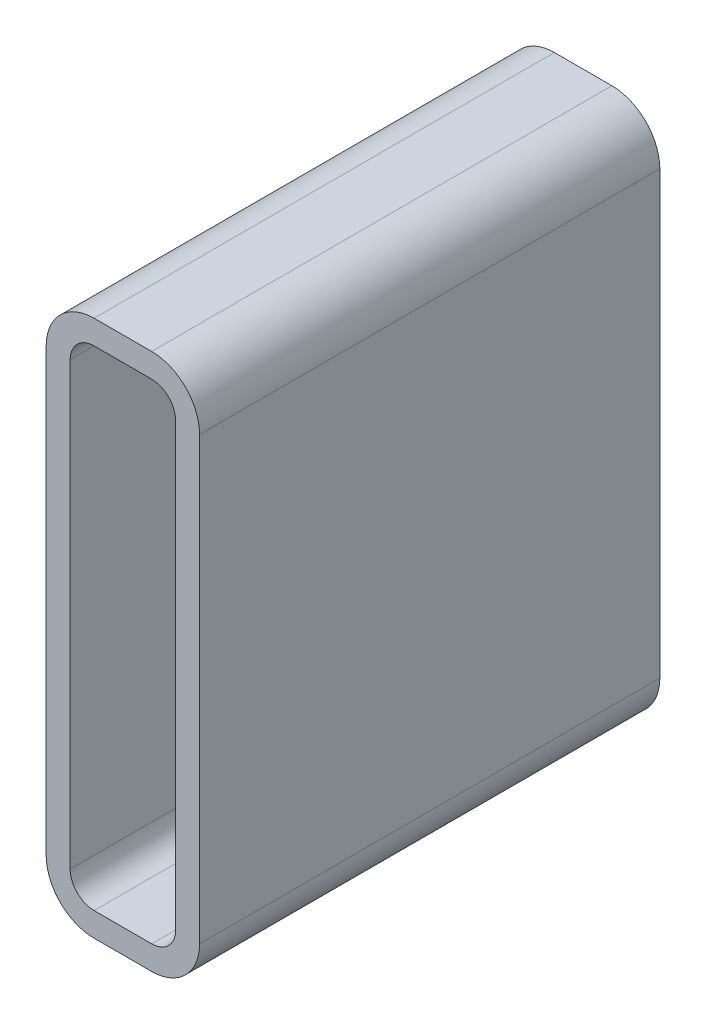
ISO-10303-21;
HEADER;
FILE_DESCRIPTION(('STEP AP214'),'2;1');
FILE_NAME('part.step','',(''),(''),'','','');
FILE_SCHEMA(('AUTOMOTIVE_DESIGN { 1 0 10303 214 1 1 1 1 }'));
ENDSEC;
DATA;
#1=APPLICATION_CONTEXT('core data for automotive mechanical design processes');
#2=APPLICATION_PROTOCOL_DEFINITION('international standard','automotive_design',2000,#1);
#3=PRODUCT_CONTEXT('',#1,'mechanical');
#4=PRODUCT('Part','Part','',(#3));
#5=PRODUCT_RELATED_PRODUCT_CATEGORY('part','',(#4));
#6=PRODUCT_DEFINITION_FORMATION('','',#4);
#7=PRODUCT_DEFINITION_CONTEXT('part definition',#1,'design');
#8=PRODUCT_DEFINITION('design','',#6,#7);
#9=PRODUCT_DEFINITION_SHAPE('','',#8);
#10=(LENGTH_UNIT() NAMED_UNIT(*) SI_UNIT(.MILLI.,.METRE.));
#11=(NAMED_UNIT(*) PLANE_ANGLE_UNIT() SI_UNIT($,.RADIAN.));
#12=(NAMED_UNIT(*) SI_UNIT($,.STERADIAN.) SOLID_ANGLE_UNIT());
#13=UNCERTAINTY_MEASURE_WITH_UNIT(LENGTH_MEASURE(1.E-05),#10,'distance_accuracy_value','');
#14=(GEOMETRIC_REPRESENTATION_CONTEXT(3) GLOBAL_UNCERTAINTY_ASSIGNED_CONTEXT((#13)) GLOBAL_UNIT_ASSIGNED_CONTEXT((#10,
#11,#12)) REPRESENTATION_CONTEXT('',''));
#15=CARTESIAN_POINT('',(0.,0.,0.));
#16=DIRECTION('',(0.,0.,1.));
#17=DIRECTION('',(1.,0.,0.));
#18=AXIS2_PLACEMENT_3D('',#15,#16,#17);
#19=CARTESIAN_POINT('',(33.4251778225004,325.678679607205,304.8));
#20=DIRECTION('',(0.,0.,1.));
#21=DIRECTION('',(1.,0.,0.));
#22=AXIS2_PLACEMENT_3D('',#19,#20,#21);
#23=PLANE('',#22);
#24=CARTESIAN_POINT('',(33.4251778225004,325.678679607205,304.8));
#25=DIRECTION('',(0.,0.,1.));
#26=DIRECTION('',(1.,0.,0.));
#27=AXIS2_PLACEMENT_3D('',#24,#25,#26);
#28=CIRCLE('',#27,31.75);
#29=CARTESIAN_POINT('',(33.4251778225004,357.428679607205,304.8));
#30=VERTEX_POINT('',#29);
#31=CARTESIAN_POINT('',(1.67517782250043,325.678679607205,304.8));
#32=VERTEX_POINT('',#31);
#33=EDGE_CURVE('E211',#30,#32,#28,.T.);
#34=ORIENTED_EDGE('',*,*,#33,.T.);
#35=DIRECTION('',(0.,-1.,0.));
#36=VECTOR('',#35,1.);
#37=CARTESIAN_POINT('',(1.67517782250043,33.5786796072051,304.8));
#38=LINE('',#37,#36);
#39=CARTESIAN_POINT('',(1.67517782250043,33.5786796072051,304.8));
#40=VERTEX_POINT('',#39);
#41=EDGE_CURVE('E214',#32,#40,#38,.T.);
#42=ORIENTED_EDGE('',*,*,#41,.T.);
#43=CARTESIAN_POINT('',(33.4251778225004,33.5786796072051,304.8));
#44=DIRECTION('',(0.,0.,1.));
#45=DIRECTION('',(1.,0.,0.));
#46=AXIS2_PLACEMENT_3D('',#43,#44,#45);
#47=CIRCLE('',#46,31.75);
#48=CARTESIAN_POINT('',(33.4251778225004,1.82867960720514,304.8));
#49=VERTEX_POINT('',#48);
#50=EDGE_CURVE('E217',#40,#49,#47,.T.);
#51=ORIENTED_EDGE('',*,*,#50,.T.);
#52=DIRECTION('',(1.,0.,0.));
#53=VECTOR('',#52,1.);
#54=CARTESIAN_POINT('',(71.5251778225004,1.82867960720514,304.8));
#55=LINE('',#54,#53);
#56=CARTESIAN_POINT('',(71.5251778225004,1.82867960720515,304.8));
#57=VERTEX_POINT('',#56);
#58=EDGE_CURVE('E219',#49,#57,#55,.T.);
#59=ORIENTED_EDGE('',*,*,#58,.T.);
#60=CARTESIAN_POINT('',(71.5251778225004,33.5786796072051,304.8));
#61=DIRECTION('',(0.,0.,1.));
#62=DIRECTION('',(1.,0.,0.));
#63=AXIS2_PLACEMENT_3D('',#60,#61,#62);
#64=CIRCLE('',#63,31.75);
#65=CARTESIAN_POINT('',(103.2751778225,33.5786796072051,304.8));
#66=VERTEX_POINT('',#65);
#67=EDGE_CURVE('E221',#57,#66,#64,.T.);
#68=ORIENTED_EDGE('',*,*,#67,.T.);
#69=DIRECTION('',(0.,1.,0.));
#70=VECTOR('',#69,1.);
#71=CARTESIAN_POINT('',(103.2751778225,325.678679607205,304.8));
#72=LINE('',#71,#70);
#73=CARTESIAN_POINT('',(103.2751778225,325.678679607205,304.8));
#74=VERTEX_POINT('',#73);
#75=EDGE_CURVE('E223',#66,#74,#72,.T.);
#76=ORIENTED_EDGE('',*,*,#75,.T.);
#77=CARTESIAN_POINT('',(71.5251778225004,325.678679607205,304.8));
#78=DIRECTION('',(0.,0.,1.));
#79=DIRECTION('',(1.,0.,0.));
#80=AXIS2_PLACEMENT_3D('',#77,#78,#79);
#81=CIRCLE('',#80,31.75);
#82=CARTESIAN_POINT('',(71.5251778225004,357.428679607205,304.8));
#83=VERTEX_POINT('',#82);
#84=EDGE_CURVE('E225',#74,#83,#81,.T.);
#85=ORIENTED_EDGE('',*,*,#84,.T.);
#86=DIRECTION('',(-1.,0.,0.));
#87=VECTOR('',#86,1.);
#88=CARTESIAN_POINT('',(33.4251778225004,357.428679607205,304.8));
#89=LINE('',#88,#87);
#90=EDGE_CURVE('E227',#83,#30,#89,.T.);
#91=ORIENTED_EDGE('',*,*,#90,.T.);
#92=EDGE_LOOP('',(#34,#42,#51,#59,#68,#76,#85,#91));
#93=FACE_BOUND('',#92,.T.);
#94=DIRECTION('',(0.,-1.,0.));
#95=VECTOR('',#94,1.);
#96=CARTESIAN_POINT('',(17.5501778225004,33.5786796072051,304.8));
#97=LINE('',#96,#95);
#98=CARTESIAN_POINT('',(17.5501778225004,325.678679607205,304.8));
#99=VERTEX_POINT('',#98);
#100=CARTESIAN_POINT('',(17.5501778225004,33.5786796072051,304.8));
#101=VERTEX_POINT('',#100);
#102=EDGE_CURVE('E154',#99,#101,#97,.T.);
#103=ORIENTED_EDGE('',*,*,#102,.F.);
#104=CARTESIAN_POINT('',(33.4251778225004,325.678679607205,304.8));
#105=DIRECTION('',(0.,0.,1.));
#106=DIRECTION('',(1.,0.,0.));
#107=AXIS2_PLACEMENT_3D('',#104,#105,#106);
#108=CIRCLE('',#107,15.875);
#109=CARTESIAN_POINT('',(33.4251778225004,341.553679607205,304.8));
#110=VERTEX_POINT('',#109);
#111=EDGE_CURVE('E146',#110,#99,#108,.T.);
#112=ORIENTED_EDGE('',*,*,#111,.F.);
#113=DIRECTION('',(-1.,0.,0.));
#114=VECTOR('',#113,1.);
#115=CARTESIAN_POINT('',(33.4251778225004,341.553679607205,304.8));
#116=LINE('',#115,#114);
#117=CARTESIAN_POINT('',(71.5251778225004,341.553679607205,304.8));
#118=VERTEX_POINT('',#117);
#119=EDGE_CURVE('E179',#118,#110,#116,.T.);
#120=ORIENTED_EDGE('',*,*,#119,.F.);
#121=CARTESIAN_POINT('',(71.5251778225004,325.678679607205,304.8));
#122=DIRECTION('',(0.,0.,1.));
#123=DIRECTION('',(1.,0.,0.));
#124=AXIS2_PLACEMENT_3D('',#121,#122,#123);
#125=CIRCLE('',#124,15.875);
#126=CARTESIAN_POINT('',(87.4001778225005,325.678679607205,304.8));
#127=VERTEX_POINT('',#126);
#128=EDGE_CURVE('E177',#127,#118,#125,.T.);
#129=ORIENTED_EDGE('',*,*,#128,.F.);
#130=DIRECTION('',(0.,1.,0.));
#131=VECTOR('',#130,1.);
#132=CARTESIAN_POINT('',(87.4001778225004,325.678679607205,304.8));
#133=LINE('',#132,#131);
#134=CARTESIAN_POINT('',(87.4001778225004,33.5786796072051,304.8));
#135=VERTEX_POINT('',#134);
#136=EDGE_CURVE('E175',#135,#127,#133,.T.);
#137=ORIENTED_EDGE('',*,*,#136,.F.);
#138=CARTESIAN_POINT('',(71.5251778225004,33.5786796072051,304.8));
#139=DIRECTION('',(0.,0.,1.));
#140=DIRECTION('',(1.,0.,0.));
#141=AXIS2_PLACEMENT_3D('',#138,#139,#140);
#142=CIRCLE('',#141,15.875);
#143=CARTESIAN_POINT('',(71.5251778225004,17.7036796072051,304.8));
#144=VERTEX_POINT('',#143);
#145=EDGE_CURVE('E173',#144,#135,#142,.T.);
#146=ORIENTED_EDGE('',*,*,#145,.F.);
#147=DIRECTION('',(1.,0.,0.));
#148=VECTOR('',#147,1.);
#149=CARTESIAN_POINT('',(71.5251778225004,17.7036796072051,304.8));
#150=LINE('',#149,#148);
#151=CARTESIAN_POINT('',(33.4251778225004,17.7036796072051,304.8));
#152=VERTEX_POINT('',#151);
#153=EDGE_CURVE('E169',#152,#144,#150,.T.);
#154=ORIENTED_EDGE('',*,*,#153,.F.);
#155=CARTESIAN_POINT('',(33.4251778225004,33.5786796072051,304.8));
#156=DIRECTION('',(0.,0.,1.));
#157=DIRECTION('',(1.,0.,0.));
#158=AXIS2_PLACEMENT_3D('',#155,#156,#157);
#159=CIRCLE('',#158,15.875);
#160=EDGE_CURVE('E167',#101,#152,#159,.T.);
#161=ORIENTED_EDGE('',*,*,#160,.F.);
#162=EDGE_LOOP('',(#103,#112,#120,#129,#137,#146,#154,#161));
#163=FACE_BOUND('',#162,.T.);
#164=ADVANCED_FACE('F33',(#93,#163),#23,.T.);
#165=CARTESIAN_POINT('',(33.4251778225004,325.678679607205,0.));
#166=DIRECTION('',(0.,0.,1.));
#167=DIRECTION('',(1.,0.,0.));
#168=AXIS2_PLACEMENT_3D('',#165,#166,#167);
#169=PLANE('',#168);
#170=CARTESIAN_POINT('',(33.4251778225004,325.678679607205,0.));
#171=DIRECTION('',(0.,0.,1.));
#172=DIRECTION('',(1.,0.,0.));
#173=AXIS2_PLACEMENT_3D('',#170,#171,#172);
#174=CIRCLE('',#173,31.75);
#175=CARTESIAN_POINT('',(33.4251778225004,357.428679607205,0.));
#176=VERTEX_POINT('',#175);
#177=CARTESIAN_POINT('',(1.67517782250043,325.678679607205,0.));
#178=VERTEX_POINT('',#177);
#179=EDGE_CURVE('E162',#176,#178,#174,.T.);
#180=ORIENTED_EDGE('',*,*,#179,.F.);
#181=DIRECTION('',(-1.,0.,0.));
#182=VECTOR('',#181,1.);
#183=CARTESIAN_POINT('',(33.4251778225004,357.428679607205,0.));
#184=LINE('',#183,#182);
#185=CARTESIAN_POINT('',(71.5251778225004,357.428679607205,0.));
#186=VERTEX_POINT('',#185);
#187=EDGE_CURVE('E215',#186,#176,#184,.T.);
#188=ORIENTED_EDGE('',*,*,#187,.F.);
#189=CARTESIAN_POINT('',(71.5251778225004,325.678679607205,0.));
#190=DIRECTION('',(0.,0.,1.));
#191=DIRECTION('',(1.,0.,0.));
#192=AXIS2_PLACEMENT_3D('',#189,#190,#191);
#193=CIRCLE('',#192,31.75);
#194=CARTESIAN_POINT('',(103.2751778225,325.678679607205,0.));
#195=VERTEX_POINT('',#194);
#196=EDGE_CURVE('E242',#195,#186,#193,.T.);
#197=ORIENTED_EDGE('',*,*,#196,.F.);
#198=DIRECTION('',(0.,1.,0.));
#199=VECTOR('',#198,1.);
#200=CARTESIAN_POINT('',(103.2751778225,325.678679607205,0.));
#201=LINE('',#200,#199);
#202=CARTESIAN_POINT('',(103.2751778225,33.5786796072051,0.));
#203=VERTEX_POINT('',#202);
#204=EDGE_CURVE('E240',#203,#195,#201,.T.);
#205=ORIENTED_EDGE('',*,*,#204,.F.);
#206=CARTESIAN_POINT('',(71.5251778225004,33.5786796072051,0.));
#207=DIRECTION('',(0.,0.,1.));
#208=DIRECTION('',(1.,0.,0.));
#209=AXIS2_PLACEMENT_3D('',#206,#207,#208);
#210=CIRCLE('',#209,31.75);
#211=CARTESIAN_POINT('',(71.5251778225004,1.82867960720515,0.));
#212=VERTEX_POINT('',#211);
#213=EDGE_CURVE('E238',#212,#203,#210,.T.);
#214=ORIENTED_EDGE('',*,*,#213,.F.);
#215=DIRECTION('',(1.,0.,0.));
#216=VECTOR('',#215,1.);
#217=CARTESIAN_POINT('',(71.5251778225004,1.82867960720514,0.));
#218=LINE('',#217,#216);
#219=CARTESIAN_POINT('',(33.4251778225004,1.82867960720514,0.));
#220=VERTEX_POINT('',#219);
#221=EDGE_CURVE('E236',#220,#212,#218,.T.);
#222=ORIENTED_EDGE('',*,*,#221,.F.);
#223=CARTESIAN_POINT('',(33.4251778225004,33.5786796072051,0.));
#224=DIRECTION('',(0.,0.,1.));
#225=DIRECTION('',(1.,0.,0.));
#226=AXIS2_PLACEMENT_3D('',#223,#224,#225);
#227=CIRCLE('',#226,31.75);
#228=CARTESIAN_POINT('',(1.67517782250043,33.5786796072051,0.));
#229=VERTEX_POINT('',#228);
#230=EDGE_CURVE('E234',#229,#220,#227,.T.);
#231=ORIENTED_EDGE('',*,*,#230,.F.);
#232=DIRECTION('',(0.,-1.,0.));
#233=VECTOR('',#232,1.);
#234=CARTESIAN_POINT('',(1.67517782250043,33.5786796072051,0.));
#235=LINE('',#234,#233);
#236=EDGE_CURVE('E232',#178,#229,#235,.T.);
#237=ORIENTED_EDGE('',*,*,#236,.F.);
#238=EDGE_LOOP('',(#180,#188,#197,#205,#214,#222,#231,#237));
#239=FACE_BOUND('',#238,.T.);
#240=CARTESIAN_POINT('',(33.4251778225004,325.678679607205,0.));
#241=DIRECTION('',(0.,0.,1.));
#242=DIRECTION('',(1.,0.,0.));
#243=AXIS2_PLACEMENT_3D('',#240,#241,#242);
#244=CIRCLE('',#243,15.875);
#245=CARTESIAN_POINT('',(33.4251778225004,341.553679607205,0.));
#246=VERTEX_POINT('',#245);
#247=CARTESIAN_POINT('',(17.5501778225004,325.678679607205,0.));
#248=VERTEX_POINT('',#247);
#249=EDGE_CURVE('E56',#246,#248,#244,.T.);
#250=ORIENTED_EDGE('',*,*,#249,.T.);
#251=DIRECTION('',(0.,-1.,0.));
#252=VECTOR('',#251,1.);
#253=CARTESIAN_POINT('',(17.5501778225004,33.5786796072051,0.));
#254=LINE('',#253,#252);
#255=CARTESIAN_POINT('',(17.5501778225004,33.5786796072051,0.));
#256=VERTEX_POINT('',#255);
#257=EDGE_CURVE('E161',#248,#256,#254,.T.);
#258=ORIENTED_EDGE('',*,*,#257,.T.);
#259=CARTESIAN_POINT('',(33.4251778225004,33.5786796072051,0.));
#260=DIRECTION('',(0.,0.,1.));
#261=DIRECTION('',(1.,0.,0.));
#262=AXIS2_PLACEMENT_3D('',#259,#260,#261);
#263=CIRCLE('',#262,15.875);
#264=CARTESIAN_POINT('',(33.4251778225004,17.7036796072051,0.));
#265=VERTEX_POINT('',#264);
#266=EDGE_CURVE('E183',#256,#265,#263,.T.);
#267=ORIENTED_EDGE('',*,*,#266,.T.);
#268=DIRECTION('',(1.,0.,0.));
#269=VECTOR('',#268,1.);
#270=CARTESIAN_POINT('',(71.5251778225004,17.7036796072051,0.));
#271=LINE('',#270,#269);
#272=CARTESIAN_POINT('',(71.5251778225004,17.7036796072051,0.));
#273=VERTEX_POINT('',#272);
#274=EDGE_CURVE('E186',#265,#273,#271,.T.);
#275=ORIENTED_EDGE('',*,*,#274,.T.);
#276=CARTESIAN_POINT('',(71.5251778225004,33.5786796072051,0.));
#277=DIRECTION('',(0.,0.,1.));
#278=DIRECTION('',(1.,0.,0.));
#279=AXIS2_PLACEMENT_3D('',#276,#277,#278);
#280=CIRCLE('',#279,15.875);
#281=CARTESIAN_POINT('',(87.4001778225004,33.5786796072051,0.));
#282=VERTEX_POINT('',#281);
#283=EDGE_CURVE('E189',#273,#282,#280,.T.);
#284=ORIENTED_EDGE('',*,*,#283,.T.);
#285=DIRECTION('',(0.,1.,0.));
#286=VECTOR('',#285,1.);
#287=CARTESIAN_POINT('',(87.4001778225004,325.678679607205,0.));
#288=LINE('',#287,#286);
#289=CARTESIAN_POINT('',(87.4001778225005,325.678679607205,0.));
#290=VERTEX_POINT('',#289);
#291=EDGE_CURVE('E192',#282,#290,#288,.T.);
#292=ORIENTED_EDGE('',*,*,#291,.T.);
#293=CARTESIAN_POINT('',(71.5251778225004,325.678679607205,0.));
#294=DIRECTION('',(0.,0.,1.));
#295=DIRECTION('',(1.,0.,0.));
#296=AXIS2_PLACEMENT_3D('',#293,#294,#295);
#297=CIRCLE('',#296,15.875);
#298=CARTESIAN_POINT('',(71.5251778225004,341.553679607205,0.));
#299=VERTEX_POINT('',#298);
#300=EDGE_CURVE('E195',#290,#299,#297,.T.);
#301=ORIENTED_EDGE('',*,*,#300,.T.);
#302=DIRECTION('',(-1.,0.,0.));
#303=VECTOR('',#302,1.);
#304=CARTESIAN_POINT('',(33.4251778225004,341.553679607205,0.));
#305=LINE('',#304,#303);
#306=EDGE_CURVE('E155',#299,#246,#305,.T.);
#307=ORIENTED_EDGE('',*,*,#306,.T.);
#308=EDGE_LOOP('',(#250,#258,#267,#275,#284,#292,#301,#307));
#309=FACE_BOUND('',#308,.T.);
#310=ADVANCED_FACE('F272',(#239,#309),#169,.F.);
#311=CARTESIAN_POINT('',(33.4251778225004,325.678679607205,304.8));
#312=DIRECTION('',(0.,0.,-1.));
#313=DIRECTION('',(-1.,0.,0.));
#314=AXIS2_PLACEMENT_3D('',#311,#312,#313);
#315=CYLINDRICAL_SURFACE('',#314,31.75);
#316=ORIENTED_EDGE('',*,*,#179,.T.);
#317=DIRECTION('',(0.,0.,-1.));
#318=VECTOR('',#317,1.);
#319=CARTESIAN_POINT('',(1.67517782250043,325.678679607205,304.8));
#320=LINE('',#319,#318);
#321=EDGE_CURVE('E11',#32,#178,#320,.T.);
#322=ORIENTED_EDGE('',*,*,#321,.F.);
#323=ORIENTED_EDGE('',*,*,#33,.F.);
#324=DIRECTION('',(0.,0.,-1.));
#325=VECTOR('',#324,1.);
#326=CARTESIAN_POINT('',(33.4251778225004,357.428679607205,304.8));
#327=LINE('',#326,#325);
#328=EDGE_CURVE('E229',#30,#176,#327,.T.);
#329=ORIENTED_EDGE('',*,*,#328,.T.);
#330=EDGE_LOOP('',(#316,#322,#323,#329));
#331=FACE_BOUND('',#330,.T.);
#332=ADVANCED_FACE('F35',(#331),#315,.T.);
#333=CARTESIAN_POINT('',(1.67517782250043,33.5786796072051,304.8));
#334=DIRECTION('',(1.,0.,0.));
#335=DIRECTION('',(0.,0.,-1.));
#336=AXIS2_PLACEMENT_3D('',#333,#334,#335);
#337=PLANE('',#336);
#338=ORIENTED_EDGE('',*,*,#236,.T.);
#339=DIRECTION('',(0.,0.,-1.));
#340=VECTOR('',#339,1.);
#341=CARTESIAN_POINT('',(1.67517782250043,33.5786796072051,304.8));
#342=LINE('',#341,#340);
#343=EDGE_CURVE('E41',#40,#229,#342,.T.);
#344=ORIENTED_EDGE('',*,*,#343,.F.);
#345=ORIENTED_EDGE('',*,*,#41,.F.);
#346=ORIENTED_EDGE('',*,*,#321,.T.);
#347=EDGE_LOOP('',(#338,#344,#345,#346));
#348=FACE_BOUND('',#347,.T.);
#349=ADVANCED_FACE('F289',(#348),#337,.F.);
#350=CARTESIAN_POINT('',(33.4251778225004,33.5786796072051,304.8));
#351=DIRECTION('',(0.,0.,-1.));
#352=DIRECTION('',(-1.,0.,0.));
#353=AXIS2_PLACEMENT_3D('',#350,#351,#352);
#354=CYLINDRICAL_SURFACE('',#353,31.75);
#355=ORIENTED_EDGE('',*,*,#230,.T.);
#356=DIRECTION('',(0.,0.,-1.));
#357=VECTOR('',#356,1.);
#358=CARTESIAN_POINT('',(33.4251778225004,1.82867960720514,304.8));
#359=LINE('',#358,#357);
#360=EDGE_CURVE('E259',#49,#220,#359,.T.);
#361=ORIENTED_EDGE('',*,*,#360,.F.);
#362=ORIENTED_EDGE('',*,*,#50,.F.);
#363=ORIENTED_EDGE('',*,*,#343,.T.);
#364=EDGE_LOOP('',(#355,#361,#362,#363));
#365=FACE_BOUND('',#364,.T.);
#366=ADVANCED_FACE('F266',(#365),#354,.T.);
#367=CARTESIAN_POINT('',(71.5251778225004,1.82867960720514,304.8));
#368=DIRECTION('',(0.,1.,0.));
#369=DIRECTION('',(0.,0.,1.));
#370=AXIS2_PLACEMENT_3D('',#367,#368,#369);
#371=PLANE('',#370);
#372=ORIENTED_EDGE('',*,*,#221,.T.);
#373=DIRECTION('',(0.,0.,-1.));
#374=VECTOR('',#373,1.);
#375=CARTESIAN_POINT('',(71.5251778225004,1.82867960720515,304.8));
#376=LINE('',#375,#374);
#377=EDGE_CURVE('E256',#57,#212,#376,.T.);
#378=ORIENTED_EDGE('',*,*,#377,.F.);
#379=ORIENTED_EDGE('',*,*,#58,.F.);
#380=ORIENTED_EDGE('',*,*,#360,.T.);
#381=EDGE_LOOP('',(#372,#378,#379,#380));
#382=FACE_BOUND('',#381,.T.);
#383=ADVANCED_FACE('F278',(#382),#371,.F.);
#384=CARTESIAN_POINT('',(71.5251778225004,33.5786796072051,304.8));
#385=DIRECTION('',(0.,0.,-1.));
#386=DIRECTION('',(-1.,0.,0.));
#387=AXIS2_PLACEMENT_3D('',#384,#385,#386);
#388=CYLINDRICAL_SURFACE('',#387,31.75);
#389=ORIENTED_EDGE('',*,*,#213,.T.);
#390=DIRECTION('',(0.,0.,-1.));
#391=VECTOR('',#390,1.);
#392=CARTESIAN_POINT('',(103.2751778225,33.5786796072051,304.8));
#393=LINE('',#392,#391);
#394=EDGE_CURVE('E253',#66,#203,#393,.T.);
#395=ORIENTED_EDGE('',*,*,#394,.F.);
#396=ORIENTED_EDGE('',*,*,#67,.F.);
#397=ORIENTED_EDGE('',*,*,#377,.T.);
#398=EDGE_LOOP('',(#389,#395,#396,#397));
#399=FACE_BOUND('',#398,.T.);
#400=ADVANCED_FACE('F282',(#399),#388,.T.);
#401=CARTESIAN_POINT('',(103.2751778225,325.678679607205,304.8));
#402=DIRECTION('',(-1.,0.,0.));
#403=DIRECTION('',(0.,0.,1.));
#404=AXIS2_PLACEMENT_3D('',#401,#402,#403);
#405=PLANE('',#404);
#406=ORIENTED_EDGE('',*,*,#204,.T.);
#407=DIRECTION('',(0.,0.,-1.));
#408=VECTOR('',#407,1.);
#409=CARTESIAN_POINT('',(103.2751778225,325.678679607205,304.8));
#410=LINE('',#409,#408);
#411=EDGE_CURVE('E250',#74,#195,#410,.T.);
#412=ORIENTED_EDGE('',*,*,#411,.F.);
#413=ORIENTED_EDGE('',*,*,#75,.F.);
#414=ORIENTED_EDGE('',*,*,#394,.T.);
#415=EDGE_LOOP('',(#406,#412,#413,#414));
#416=FACE_BOUND('',#415,.T.);
#417=ADVANCED_FACE('F302',(#416),#405,.F.);
#418=CARTESIAN_POINT('',(71.5251778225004,325.678679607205,304.8));
#419=DIRECTION('',(0.,0.,-1.));
#420=DIRECTION('',(-1.,0.,0.));
#421=AXIS2_PLACEMENT_3D('',#418,#419,#420);
#422=CYLINDRICAL_SURFACE('',#421,31.75);
#423=ORIENTED_EDGE('',*,*,#196,.T.);
#424=DIRECTION('',(0.,0.,-1.));
#425=VECTOR('',#424,1.);
#426=CARTESIAN_POINT('',(71.5251778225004,357.428679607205,304.8));
#427=LINE('',#426,#425);
#428=EDGE_CURVE('E247',#83,#186,#427,.T.);
#429=ORIENTED_EDGE('',*,*,#428,.F.);
#430=ORIENTED_EDGE('',*,*,#84,.F.);
#431=ORIENTED_EDGE('',*,*,#411,.T.);
#432=EDGE_LOOP('',(#423,#429,#430,#431));
#433=FACE_BOUND('',#432,.T.);
#434=ADVANCED_FACE('F300',(#433),#422,.T.);
#435=CARTESIAN_POINT('',(33.4251778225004,357.428679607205,304.8));
#436=DIRECTION('',(0.,-1.,0.));
#437=DIRECTION('',(0.,0.,-1.));
#438=AXIS2_PLACEMENT_3D('',#435,#436,#437);
#439=PLANE('',#438);
#440=ORIENTED_EDGE('',*,*,#187,.T.);
#441=ORIENTED_EDGE('',*,*,#328,.F.);
#442=ORIENTED_EDGE('',*,*,#90,.F.);
#443=ORIENTED_EDGE('',*,*,#428,.T.);
#444=EDGE_LOOP('',(#440,#441,#442,#443));
#445=FACE_BOUND('',#444,.T.);
#446=ADVANCED_FACE('F295',(#445),#439,.F.);
#447=CARTESIAN_POINT('',(33.4251778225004,325.678679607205,304.8));
#448=DIRECTION('',(0.,0.,-1.));
#449=DIRECTION('',(-1.,0.,0.));
#450=AXIS2_PLACEMENT_3D('',#447,#448,#449);
#451=CYLINDRICAL_SURFACE('',#450,15.875);
#452=ORIENTED_EDGE('',*,*,#249,.F.);
#453=DIRECTION('',(0.,0.,-1.));
#454=VECTOR('',#453,1.);
#455=CARTESIAN_POINT('',(33.4251778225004,341.553679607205,304.8));
#456=LINE('',#455,#454);
#457=EDGE_CURVE('E150',#110,#246,#456,.T.);
#458=ORIENTED_EDGE('',*,*,#457,.F.);
#459=ORIENTED_EDGE('',*,*,#111,.T.);
#460=DIRECTION('',(0.,0.,-1.));
#461=VECTOR('',#460,1.);
#462=CARTESIAN_POINT('',(17.5501778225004,325.678679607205,304.8));
#463=LINE('',#462,#461);
#464=EDGE_CURVE('E149',#99,#248,#463,.T.);
#465=ORIENTED_EDGE('',*,*,#464,.T.);
#466=EDGE_LOOP('',(#452,#458,#459,#465));
#467=FACE_BOUND('',#466,.T.);
#468=ADVANCED_FACE('F148',(#467),#451,.F.);
#469=CARTESIAN_POINT('',(17.5501778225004,33.5786796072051,304.8));
#470=DIRECTION('',(1.,0.,0.));
#471=DIRECTION('',(0.,0.,-1.));
#472=AXIS2_PLACEMENT_3D('',#469,#470,#471);
#473=PLANE('',#472);
#474=ORIENTED_EDGE('',*,*,#257,.F.);
#475=ORIENTED_EDGE('',*,*,#464,.F.);
#476=ORIENTED_EDGE('',*,*,#102,.T.);
#477=DIRECTION('',(0.,0.,-1.));
#478=VECTOR('',#477,1.);
#479=CARTESIAN_POINT('',(17.5501778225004,33.5786796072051,304.8));
#480=LINE('',#479,#478);
#481=EDGE_CURVE('E163',#101,#256,#480,.T.);
#482=ORIENTED_EDGE('',*,*,#481,.T.);
#483=EDGE_LOOP('',(#474,#475,#476,#482));
#484=FACE_BOUND('',#483,.T.);
#485=ADVANCED_FACE('F158',(#484),#473,.T.);
#486=CARTESIAN_POINT('',(33.4251778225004,33.5786796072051,304.8));
#487=DIRECTION('',(0.,0.,-1.));
#488=DIRECTION('',(-1.,0.,0.));
#489=AXIS2_PLACEMENT_3D('',#486,#487,#488);
#490=CYLINDRICAL_SURFACE('',#489,15.875);
#491=ORIENTED_EDGE('',*,*,#266,.F.);
#492=ORIENTED_EDGE('',*,*,#481,.F.);
#493=ORIENTED_EDGE('',*,*,#160,.T.);
#494=DIRECTION('',(0.,0.,-1.));
#495=VECTOR('',#494,1.);
#496=CARTESIAN_POINT('',(33.4251778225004,17.7036796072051,304.8));
#497=LINE('',#496,#495);
#498=EDGE_CURVE('E208',#152,#265,#497,.T.);
#499=ORIENTED_EDGE('',*,*,#498,.T.);
#500=EDGE_LOOP('',(#491,#492,#493,#499));
#501=FACE_BOUND('',#500,.T.);
#502=ADVANCED_FACE('F327',(#501),#490,.F.);
#503=CARTESIAN_POINT('',(71.5251778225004,17.7036796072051,304.8));
#504=DIRECTION('',(0.,1.,0.));
#505=DIRECTION('',(0.,0.,1.));
#506=AXIS2_PLACEMENT_3D('',#503,#504,#505);
#507=PLANE('',#506);
#508=ORIENTED_EDGE('',*,*,#274,.F.);
#509=ORIENTED_EDGE('',*,*,#498,.F.);
#510=ORIENTED_EDGE('',*,*,#153,.T.);
#511=DIRECTION('',(0.,0.,-1.));
#512=VECTOR('',#511,1.);
#513=CARTESIAN_POINT('',(71.5251778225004,17.7036796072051,304.8));
#514=LINE('',#513,#512);
#515=EDGE_CURVE('E206',#144,#273,#514,.T.);
#516=ORIENTED_EDGE('',*,*,#515,.T.);
#517=EDGE_LOOP('',(#508,#509,#510,#516));
#518=FACE_BOUND('',#517,.T.);
#519=ADVANCED_FACE('F331',(#518),#507,.T.);
#520=CARTESIAN_POINT('',(71.5251778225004,33.5786796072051,304.8));
#521=DIRECTION('',(0.,0.,-1.));
#522=DIRECTION('',(-1.,0.,0.));
#523=AXIS2_PLACEMENT_3D('',#520,#521,#522);
#524=CYLINDRICAL_SURFACE('',#523,15.875);
#525=ORIENTED_EDGE('',*,*,#283,.F.);
#526=ORIENTED_EDGE('',*,*,#515,.F.);
#527=ORIENTED_EDGE('',*,*,#145,.T.);
#528=DIRECTION('',(0.,0.,-1.));
#529=VECTOR('',#528,1.);
#530=CARTESIAN_POINT('',(87.4001778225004,33.5786796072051,304.8));
#531=LINE('',#530,#529);
#532=EDGE_CURVE('E204',#135,#282,#531,.T.);
#533=ORIENTED_EDGE('',*,*,#532,.T.);
#534=EDGE_LOOP('',(#525,#526,#527,#533));
#535=FACE_BOUND('',#534,.T.);
#536=ADVANCED_FACE('F337',(#535),#524,.F.);
#537=CARTESIAN_POINT('',(87.4001778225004,325.678679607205,304.8));
#538=DIRECTION('',(-1.,0.,0.));
#539=DIRECTION('',(0.,0.,1.));
#540=AXIS2_PLACEMENT_3D('',#537,#538,#539);
#541=PLANE('',#540);
#542=ORIENTED_EDGE('',*,*,#291,.F.);
#543=ORIENTED_EDGE('',*,*,#532,.F.);
#544=ORIENTED_EDGE('',*,*,#136,.T.);
#545=DIRECTION('',(0.,0.,-1.));
#546=VECTOR('',#545,1.);
#547=CARTESIAN_POINT('',(87.4001778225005,325.678679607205,304.8));
#548=LINE('',#547,#546);
#549=EDGE_CURVE('E202',#127,#290,#548,.T.);
#550=ORIENTED_EDGE('',*,*,#549,.T.);
#551=EDGE_LOOP('',(#542,#543,#544,#550));
#552=FACE_BOUND('',#551,.T.);
#553=ADVANCED_FACE('F341',(#552),#541,.T.);
#554=CARTESIAN_POINT('',(71.5251778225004,325.678679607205,304.8));
#555=DIRECTION('',(0.,0.,-1.));
#556=DIRECTION('',(-1.,0.,0.));
#557=AXIS2_PLACEMENT_3D('',#554,#555,#556);
#558=CYLINDRICAL_SURFACE('',#557,15.875);
#559=ORIENTED_EDGE('',*,*,#300,.F.);
#560=ORIENTED_EDGE('',*,*,#549,.F.);
#561=ORIENTED_EDGE('',*,*,#128,.T.);
#562=DIRECTION('',(0.,0.,-1.));
#563=VECTOR('',#562,1.);
#564=CARTESIAN_POINT('',(71.5251778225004,341.553679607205,304.8));
#565=LINE('',#564,#563);
#566=EDGE_CURVE('E48',#118,#299,#565,.T.);
#567=ORIENTED_EDGE('',*,*,#566,.T.);
#568=EDGE_LOOP('',(#559,#560,#561,#567));
#569=FACE_BOUND('',#568,.T.);
#570=ADVANCED_FACE('F345',(#569),#558,.F.);
#571=CARTESIAN_POINT('',(33.4251778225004,341.553679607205,304.8));
#572=DIRECTION('',(0.,-1.,0.));
#573=DIRECTION('',(0.,0.,-1.));
#574=AXIS2_PLACEMENT_3D('',#571,#572,#573);
#575=PLANE('',#574);
#576=ORIENTED_EDGE('',*,*,#306,.F.);
#577=ORIENTED_EDGE('',*,*,#566,.F.);
#578=ORIENTED_EDGE('',*,*,#119,.T.);
#579=ORIENTED_EDGE('',*,*,#457,.T.);
#580=EDGE_LOOP('',(#576,#577,#578,#579));
#581=FACE_BOUND('',#580,.T.);
#582=ADVANCED_FACE('F349',(#581),#575,.T.);
#583=CLOSED_SHELL('',(#164,#310,#332,#349,#366,#383,#400,#417,#434,#446,#468,#485,#502,#519,
#536,#553,#570,#582));
#584=MANIFOLD_SOLID_BREP('B2',#583);
#585=ADVANCED_BREP_SHAPE_REPRESENTATION('',(#18,#584),#14);
#586=SHAPE_DEFINITION_REPRESENTATION(#9,#585);
ENDSEC;
END-ISO-10303-21;
